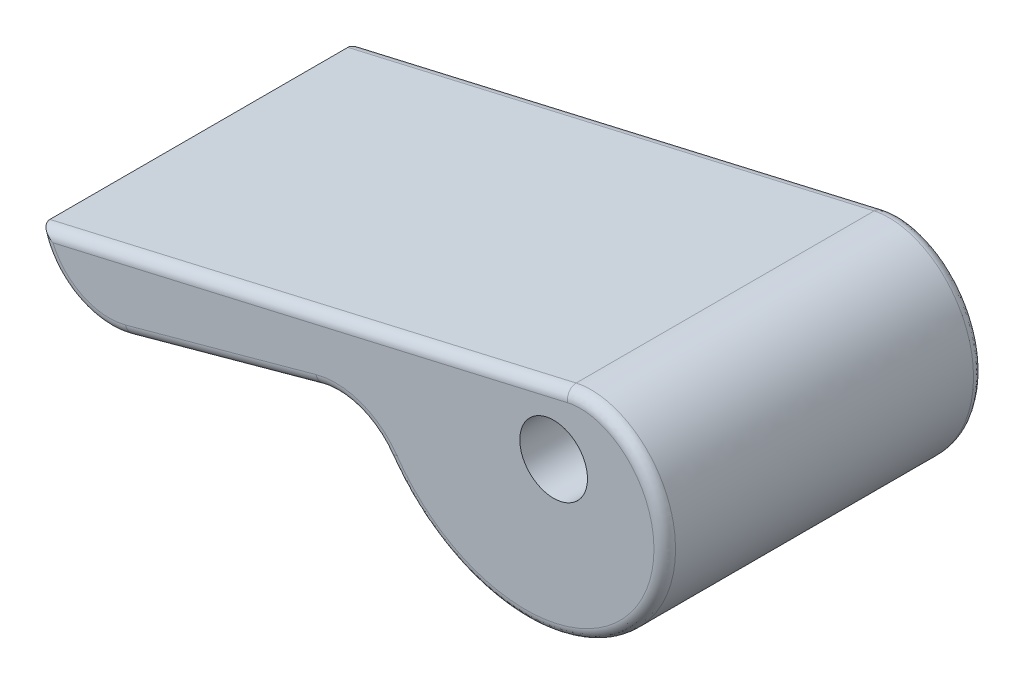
from build123d import *

# Parameters (mm, degrees)
EXTRUDE1_DEPTH     = 11.27125
SKETCH3_R          = 2.3876
CUT_EXTRUDE1_DEPTH = 45.106664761
FILLET2_R          = 0.762


with BuildPart() as part:
    # Sketch2 → Extrude1 (new, symmetric)
    with BuildSketch(Plane.XY):
        with BuildLine():
            Line((0.826999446, 4.690146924), (-36.296947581, -3.878549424))
            ThreePointArc((-36.296947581, -3.878549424), (-33.950126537, -7.098463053), (-30.001985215, -7.634739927))
            Line((-30.001985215, -7.634739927), (-16.563907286, -3.944851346))
            ThreePointArc((-16.563907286, -3.944851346), (-13.852024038, -4.052724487), (-11.700051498, -5.706496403))
            add(Edge.make_bspline(
                [(0.826999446, 4.690146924), (1.255923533, 4.789148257), (1.719476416, 4.829184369), (2.679335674, 4.767589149), (3.175533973, 4.665874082), (4.156729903, 4.308368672), (4.641597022, 4.052528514), (5.552494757, 3.387946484), (5.978382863, 2.979194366), (6.724142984, 2.024463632), (7.043872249, 1.478516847), (7.534917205, 0.279256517), (7.706102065, -0.373984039), (7.866594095, -1.745366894), (7.855793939, -2.463399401), (7.631401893, -3.91205794), (7.417736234, -4.64254491), (6.782003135, -6.057726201), (6.359903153, -6.742262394), (5.318617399, -8.005578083), (4.69944492, -8.584192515), (3.292559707, -9.579019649), (2.504907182, -9.995073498), (0.805735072, -10.616364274), (-0.105680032, -10.821461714), (-1.994060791, -10.985180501), (-2.970883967, -10.943693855), (-4.921853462, -10.595099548), (-5.895828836, -10.287925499), (-7.767706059, -9.407978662), (-8.665420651, -8.83518833), (-10.311633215, -7.444482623), (-11.059941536, -6.626602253), (-11.700051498, -5.706496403)],
                knots=[0, 0, 0, 0, 0.0625, 0.0625, 0.125, 0.125, 0.1875, 0.1875, 0.25, 0.25, 0.3125, 0.3125, 0.375, 0.375, 0.4375, 0.4375, 0.5, 0.5, 0.5625, 0.5625, 0.625, 0.625, 0.6875, 0.6875, 0.75, 0.75, 0.8125, 0.8125, 0.875, 0.875, 0.9375, 0.9375, 1, 1, 1, 1], degree=3))
        make_face()
    extrude(amount=EXTRUDE1_DEPTH, both=True)

    # Sketch3 → Cut-Extrude1 (cut, through all)
    with BuildSketch(Plane.XY.offset(11.27125)):
        Circle(SKETCH3_R)
    extrude(amount=-CUT_EXTRUDE1_DEPTH, mode=Mode.SUBTRACT)

    # Fillet2
    fillet2_edges = [part.edges().sort_by_distance(p)[0] for p in [
        (-33.950126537, -7.098463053, 11.27125),
        (-23.28294625, -5.789795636, 11.27125),
        (-13.852024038, -4.052724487, 11.27125),
        (-13.852024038, -4.052724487, -11.27125),
        (-23.28294625, -5.789795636, -11.27125),
        (-17.734974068, 0.40579875, -11.27125),
        (-17.734974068, 0.40579875, 11.27125),
    ]]
    fillet(fillet2_edges, radius=FILLET2_R)


solid = part.part
